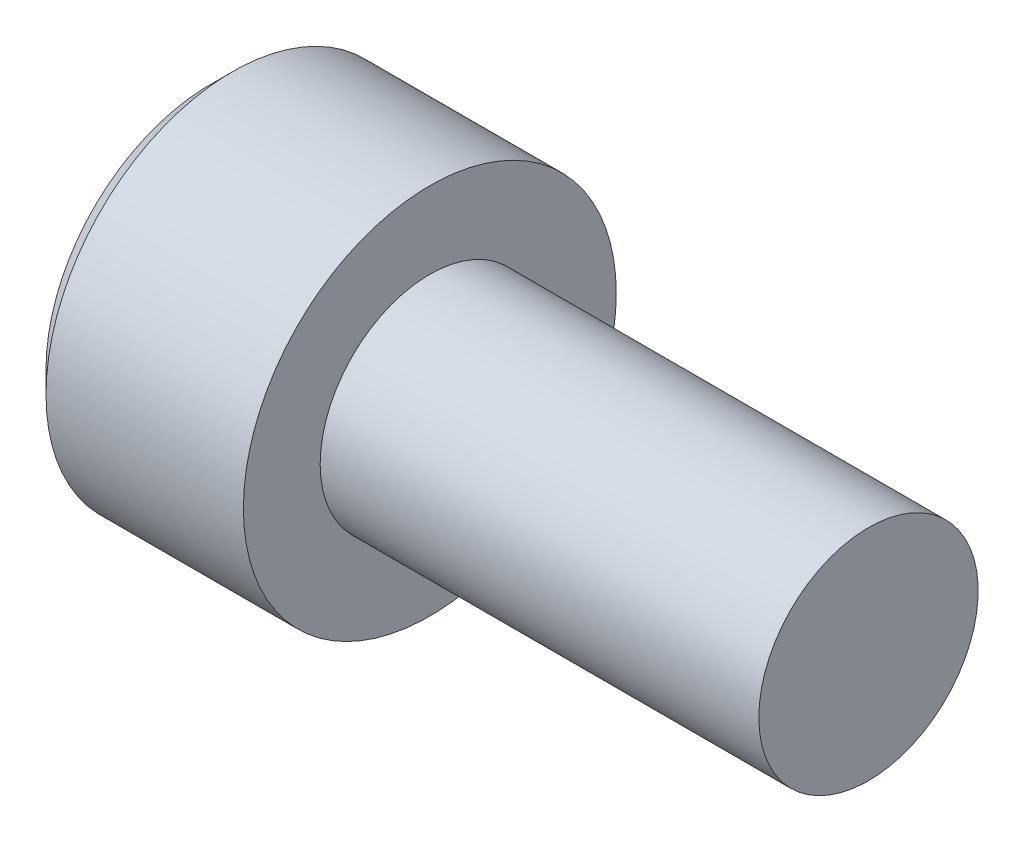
ISO-10303-21;
HEADER;
FILE_DESCRIPTION(('STEP AP214'),'2;1');
FILE_NAME('part.step','',(''),(''),'','','');
FILE_SCHEMA(('AUTOMOTIVE_DESIGN { 1 0 10303 214 1 1 1 1 }'));
ENDSEC;
DATA;
#1=APPLICATION_CONTEXT('core data for automotive mechanical design processes');
#2=APPLICATION_PROTOCOL_DEFINITION('international standard','automotive_design',2000,#1);
#3=PRODUCT_CONTEXT('',#1,'mechanical');
#4=PRODUCT('Part','Part','',(#3));
#5=PRODUCT_RELATED_PRODUCT_CATEGORY('part','',(#4));
#6=PRODUCT_DEFINITION_FORMATION('','',#4);
#7=PRODUCT_DEFINITION_CONTEXT('part definition',#1,'design');
#8=PRODUCT_DEFINITION('design','',#6,#7);
#9=PRODUCT_DEFINITION_SHAPE('','',#8);
#10=(LENGTH_UNIT() NAMED_UNIT(*) SI_UNIT(.MILLI.,.METRE.));
#11=(NAMED_UNIT(*) PLANE_ANGLE_UNIT() SI_UNIT($,.RADIAN.));
#12=(NAMED_UNIT(*) SI_UNIT($,.STERADIAN.) SOLID_ANGLE_UNIT());
#13=UNCERTAINTY_MEASURE_WITH_UNIT(LENGTH_MEASURE(1.E-05),#10,'distance_accuracy_value','');
#14=(GEOMETRIC_REPRESENTATION_CONTEXT(3) GLOBAL_UNCERTAINTY_ASSIGNED_CONTEXT((#13)) GLOBAL_UNIT_ASSIGNED_CONTEXT((#10,
#11,#12)) REPRESENTATION_CONTEXT('',''));
#15=CARTESIAN_POINT('',(0.,0.,0.));
#16=DIRECTION('',(0.,0.,1.));
#17=DIRECTION('',(1.,0.,0.));
#18=AXIS2_PLACEMENT_3D('',#15,#16,#17);
#19=CARTESIAN_POINT('',(0.,2.5,0.));
#20=DIRECTION('',(-1.,0.,0.));
#21=DIRECTION('',(0.,0.,1.));
#22=AXIS2_PLACEMENT_3D('',#19,#20,#21);
#23=PLANE('',#22);
#24=CARTESIAN_POINT('',(0.,0.,0.));
#25=DIRECTION('',(-1.,0.,0.));
#26=DIRECTION('',(0.,0.,1.));
#27=AXIS2_PLACEMENT_3D('',#24,#25,#26);
#28=CIRCLE('',#27,4.25);
#29=CARTESIAN_POINT('',(0.,0.,4.25));
#30=VERTEX_POINT('',#29);
#31=EDGE_CURVE('E147',#30,#30,#28,.T.);
#32=ORIENTED_EDGE('',*,*,#31,.F.);
#33=EDGE_LOOP('',(#32));
#34=FACE_BOUND('',#33,.T.);
#35=CARTESIAN_POINT('',(0.,0.,0.));
#36=DIRECTION('',(-1.,0.,0.));
#37=DIRECTION('',(0.,0.,1.));
#38=AXIS2_PLACEMENT_3D('',#35,#36,#37);
#39=CIRCLE('',#38,2.5);
#40=CARTESIAN_POINT('',(0.,0.,2.5));
#41=VERTEX_POINT('',#40);
#42=EDGE_CURVE('E136',#41,#41,#39,.T.);
#43=ORIENTED_EDGE('',*,*,#42,.T.);
#44=EDGE_LOOP('',(#43));
#45=FACE_BOUND('',#44,.T.);
#46=ADVANCED_FACE('F34',(#34,#45),#23,.F.);
#47=CARTESIAN_POINT('',(-5.,0.,0.));
#48=DIRECTION('',(-1.,0.,0.));
#49=DIRECTION('',(0.,0.,1.));
#50=AXIS2_PLACEMENT_3D('',#47,#48,#49);
#51=CYLINDRICAL_SURFACE('',#50,4.25);
#52=CARTESIAN_POINT('',(-4.5,0.,0.));
#53=DIRECTION('',(1.,0.,0.));
#54=DIRECTION('',(0.,0.,-1.));
#55=AXIS2_PLACEMENT_3D('',#52,#53,#54);
#56=CIRCLE('',#55,4.25);
#57=CARTESIAN_POINT('',(-4.5,0.,-4.25));
#58=VERTEX_POINT('',#57);
#59=EDGE_CURVE('E11',#58,#58,#56,.T.);
#60=ORIENTED_EDGE('',*,*,#59,.T.);
#61=EDGE_LOOP('',(#60));
#62=FACE_BOUND('',#61,.T.);
#63=ORIENTED_EDGE('',*,*,#31,.T.);
#64=EDGE_LOOP('',(#63));
#65=FACE_BOUND('',#64,.T.);
#66=ADVANCED_FACE('F164',(#62,#65),#51,.T.);
#67=CARTESIAN_POINT('',(-5.,0.,0.));
#68=DIRECTION('',(1.,0.,0.));
#69=DIRECTION('',(0.,0.,-1.));
#70=AXIS2_PLACEMENT_3D('',#67,#68,#69);
#71=PLANE('',#70);
#72=CARTESIAN_POINT('',(-5.,0.,0.));
#73=DIRECTION('',(1.,0.,0.));
#74=DIRECTION('',(0.,0.,-1.));
#75=AXIS2_PLACEMENT_3D('',#72,#73,#74);
#76=CIRCLE('',#75,3.75);
#77=CARTESIAN_POINT('',(-5.,0.,-3.75));
#78=VERTEX_POINT('',#77);
#79=EDGE_CURVE('E42',#78,#78,#76,.F.);
#80=ORIENTED_EDGE('',*,*,#79,.T.);
#81=EDGE_LOOP('',(#80));
#82=FACE_BOUND('',#81,.T.);
#83=DIRECTION('',(0.,0.5,-0.866025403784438));
#84=VECTOR('',#83,1.);
#85=CARTESIAN_POINT('',(-5.,1.15470053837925,2.));
#86=LINE('',#85,#84);
#87=CARTESIAN_POINT('',(-5.,1.15470053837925,2.));
#88=VERTEX_POINT('',#87);
#89=CARTESIAN_POINT('',(-5.,2.3094010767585,0.));
#90=VERTEX_POINT('',#89);
#91=EDGE_CURVE('E123',#88,#90,#86,.T.);
#92=ORIENTED_EDGE('',*,*,#91,.F.);
#93=DIRECTION('',(0.,1.,0.));
#94=VECTOR('',#93,1.);
#95=CARTESIAN_POINT('',(-5.,-1.15470053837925,2.));
#96=LINE('',#95,#94);
#97=CARTESIAN_POINT('',(-5.,-1.15470053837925,2.));
#98=VERTEX_POINT('',#97);
#99=EDGE_CURVE('E49',#98,#88,#96,.T.);
#100=ORIENTED_EDGE('',*,*,#99,.F.);
#101=DIRECTION('',(0.,0.5,0.866025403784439));
#102=VECTOR('',#101,1.);
#103=CARTESIAN_POINT('',(-5.,-2.3094010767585,0.));
#104=LINE('',#103,#102);
#105=CARTESIAN_POINT('',(-5.,-2.3094010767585,0.));
#106=VERTEX_POINT('',#105);
#107=EDGE_CURVE('E132',#106,#98,#104,.T.);
#108=ORIENTED_EDGE('',*,*,#107,.F.);
#109=DIRECTION('',(0.,-0.5,0.866025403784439));
#110=VECTOR('',#109,1.);
#111=CARTESIAN_POINT('',(-5.,-1.15470053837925,-2.));
#112=LINE('',#111,#110);
#113=CARTESIAN_POINT('',(-5.,-1.15470053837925,-2.));
#114=VERTEX_POINT('',#113);
#115=EDGE_CURVE('E130',#114,#106,#112,.T.);
#116=ORIENTED_EDGE('',*,*,#115,.F.);
#117=DIRECTION('',(0.,-1.,0.));
#118=VECTOR('',#117,1.);
#119=CARTESIAN_POINT('',(-5.,1.15470053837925,-2.));
#120=LINE('',#119,#118);
#121=CARTESIAN_POINT('',(-5.,1.15470053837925,-2.));
#122=VERTEX_POINT('',#121);
#123=EDGE_CURVE('E97',#122,#114,#120,.T.);
#124=ORIENTED_EDGE('',*,*,#123,.F.);
#125=DIRECTION('',(0.,-0.5,-0.866025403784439));
#126=VECTOR('',#125,1.);
#127=CARTESIAN_POINT('',(-5.,2.3094010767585,0.));
#128=LINE('',#127,#126);
#129=EDGE_CURVE('E126',#90,#122,#128,.T.);
#130=ORIENTED_EDGE('',*,*,#129,.F.);
#131=EDGE_LOOP('',(#92,#100,#108,#116,#124,#130));
#132=FACE_BOUND('',#131,.T.);
#133=ADVANCED_FACE('F152',(#82,#132),#71,.F.);
#134=CARTESIAN_POINT('',(10.,2.5,0.));
#135=DIRECTION('',(-1.,0.,0.));
#136=DIRECTION('',(0.,0.,1.));
#137=AXIS2_PLACEMENT_3D('',#134,#135,#136);
#138=PLANE('',#137);
#139=CARTESIAN_POINT('',(10.,0.,0.));
#140=DIRECTION('',(-1.,0.,0.));
#141=DIRECTION('',(0.,0.,1.));
#142=AXIS2_PLACEMENT_3D('',#139,#140,#141);
#143=CIRCLE('',#142,2.5);
#144=CARTESIAN_POINT('',(10.,0.,2.5));
#145=VERTEX_POINT('',#144);
#146=EDGE_CURVE('E144',#145,#145,#143,.T.);
#147=ORIENTED_EDGE('',*,*,#146,.F.);
#148=EDGE_LOOP('',(#147));
#149=FACE_BOUND('',#148,.T.);
#150=ADVANCED_FACE('F176',(#149),#138,.F.);
#151=CARTESIAN_POINT('',(-5.,0.,0.));
#152=DIRECTION('',(-1.,0.,0.));
#153=DIRECTION('',(0.,0.,1.));
#154=AXIS2_PLACEMENT_3D('',#151,#152,#153);
#155=CYLINDRICAL_SURFACE('',#154,2.5);
#156=ORIENTED_EDGE('',*,*,#42,.F.);
#157=EDGE_LOOP('',(#156));
#158=FACE_BOUND('',#157,.T.);
#159=ORIENTED_EDGE('',*,*,#146,.T.);
#160=EDGE_LOOP('',(#159));
#161=FACE_BOUND('',#160,.T.);
#162=ADVANCED_FACE('F179',(#158,#161),#155,.T.);
#163=CARTESIAN_POINT('',(-2.5,-1.15470053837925,2.));
#164=DIRECTION('',(0.,0.,1.));
#165=DIRECTION('',(0.,-1.,0.));
#166=AXIS2_PLACEMENT_3D('',#163,#164,#165);
#167=PLANE('',#166);
#168=ORIENTED_EDGE('',*,*,#99,.T.);
#169=DIRECTION('',(-1.,0.,0.));
#170=VECTOR('',#169,1.);
#171=CARTESIAN_POINT('',(-2.5,1.15470053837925,2.));
#172=LINE('',#171,#170);
#173=CARTESIAN_POINT('',(-2.5,1.15470053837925,2.));
#174=VERTEX_POINT('',#173);
#175=EDGE_CURVE('E79',#174,#88,#172,.T.);
#176=ORIENTED_EDGE('',*,*,#175,.F.);
#177=DIRECTION('',(0.,1.,0.));
#178=VECTOR('',#177,1.);
#179=CARTESIAN_POINT('',(-2.5,-1.15470053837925,2.));
#180=LINE('',#179,#178);
#181=CARTESIAN_POINT('',(-2.5,-1.15470053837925,2.));
#182=VERTEX_POINT('',#181);
#183=EDGE_CURVE('E134',#182,#174,#180,.T.);
#184=ORIENTED_EDGE('',*,*,#183,.F.);
#185=DIRECTION('',(-1.,0.,0.));
#186=VECTOR('',#185,1.);
#187=CARTESIAN_POINT('',(-2.5,-1.15470053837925,2.));
#188=LINE('',#187,#186);
#189=EDGE_CURVE('E57',#182,#98,#188,.T.);
#190=ORIENTED_EDGE('',*,*,#189,.T.);
#191=EDGE_LOOP('',(#168,#176,#184,#190));
#192=FACE_BOUND('',#191,.T.);
#193=ADVANCED_FACE('F183',(#192),#167,.F.);
#194=CARTESIAN_POINT('',(-2.5,-2.3094010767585,0.));
#195=DIRECTION('',(0.,-0.866025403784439,0.5));
#196=DIRECTION('',(0.,-0.5,-0.866025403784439));
#197=AXIS2_PLACEMENT_3D('',#194,#195,#196);
#198=PLANE('',#197);
#199=ORIENTED_EDGE('',*,*,#107,.T.);
#200=ORIENTED_EDGE('',*,*,#189,.F.);
#201=DIRECTION('',(0.,0.5,0.866025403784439));
#202=VECTOR('',#201,1.);
#203=CARTESIAN_POINT('',(-2.5,-2.3094010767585,0.));
#204=LINE('',#203,#202);
#205=CARTESIAN_POINT('',(-2.5,-2.3094010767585,0.));
#206=VERTEX_POINT('',#205);
#207=EDGE_CURVE('E109',#206,#182,#204,.T.);
#208=ORIENTED_EDGE('',*,*,#207,.F.);
#209=DIRECTION('',(-1.,0.,0.));
#210=VECTOR('',#209,1.);
#211=CARTESIAN_POINT('',(-2.5,-2.3094010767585,0.));
#212=LINE('',#211,#210);
#213=EDGE_CURVE('E101',#206,#106,#212,.T.);
#214=ORIENTED_EDGE('',*,*,#213,.T.);
#215=EDGE_LOOP('',(#199,#200,#208,#214));
#216=FACE_BOUND('',#215,.T.);
#217=ADVANCED_FACE('F187',(#216),#198,.F.);
#218=CARTESIAN_POINT('',(-2.5,-1.15470053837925,-2.));
#219=DIRECTION('',(0.,-0.866025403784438,-0.5));
#220=DIRECTION('',(0.,0.5,-0.866025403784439));
#221=AXIS2_PLACEMENT_3D('',#218,#219,#220);
#222=PLANE('',#221);
#223=ORIENTED_EDGE('',*,*,#115,.T.);
#224=ORIENTED_EDGE('',*,*,#213,.F.);
#225=DIRECTION('',(0.,-0.5,0.866025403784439));
#226=VECTOR('',#225,1.);
#227=CARTESIAN_POINT('',(-2.5,-1.15470053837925,-2.));
#228=LINE('',#227,#226);
#229=CARTESIAN_POINT('',(-2.5,-1.15470053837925,-2.));
#230=VERTEX_POINT('',#229);
#231=EDGE_CURVE('E105',#230,#206,#228,.T.);
#232=ORIENTED_EDGE('',*,*,#231,.F.);
#233=DIRECTION('',(-1.,0.,0.));
#234=VECTOR('',#233,1.);
#235=CARTESIAN_POINT('',(-2.5,-1.15470053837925,-2.));
#236=LINE('',#235,#234);
#237=EDGE_CURVE('E90',#230,#114,#236,.T.);
#238=ORIENTED_EDGE('',*,*,#237,.T.);
#239=EDGE_LOOP('',(#223,#224,#232,#238));
#240=FACE_BOUND('',#239,.T.);
#241=ADVANCED_FACE('F106',(#240),#222,.F.);
#242=CARTESIAN_POINT('',(-2.5,1.15470053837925,-2.));
#243=DIRECTION('',(0.,0.,-1.));
#244=DIRECTION('',(-1.,0.,0.));
#245=AXIS2_PLACEMENT_3D('',#242,#243,#244);
#246=PLANE('',#245);
#247=ORIENTED_EDGE('',*,*,#123,.T.);
#248=ORIENTED_EDGE('',*,*,#237,.F.);
#249=DIRECTION('',(0.,-1.,0.));
#250=VECTOR('',#249,1.);
#251=CARTESIAN_POINT('',(-2.5,1.15470053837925,-2.));
#252=LINE('',#251,#250);
#253=CARTESIAN_POINT('',(-2.5,1.15470053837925,-2.));
#254=VERTEX_POINT('',#253);
#255=EDGE_CURVE('E94',#254,#230,#252,.T.);
#256=ORIENTED_EDGE('',*,*,#255,.F.);
#257=DIRECTION('',(-1.,0.,0.));
#258=VECTOR('',#257,1.);
#259=CARTESIAN_POINT('',(-2.5,1.15470053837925,-2.));
#260=LINE('',#259,#258);
#261=EDGE_CURVE('E102',#254,#122,#260,.T.);
#262=ORIENTED_EDGE('',*,*,#261,.T.);
#263=EDGE_LOOP('',(#247,#248,#256,#262));
#264=FACE_BOUND('',#263,.T.);
#265=ADVANCED_FACE('F92',(#264),#246,.F.);
#266=CARTESIAN_POINT('',(-2.5,2.3094010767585,0.));
#267=DIRECTION('',(0.,0.866025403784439,-0.5));
#268=DIRECTION('',(0.,0.5,0.866025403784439));
#269=AXIS2_PLACEMENT_3D('',#266,#267,#268);
#270=PLANE('',#269);
#271=ORIENTED_EDGE('',*,*,#129,.T.);
#272=ORIENTED_EDGE('',*,*,#261,.F.);
#273=DIRECTION('',(0.,-0.5,-0.866025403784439));
#274=VECTOR('',#273,1.);
#275=CARTESIAN_POINT('',(-2.5,2.3094010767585,0.));
#276=LINE('',#275,#274);
#277=CARTESIAN_POINT('',(-2.5,2.3094010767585,0.));
#278=VERTEX_POINT('',#277);
#279=EDGE_CURVE('E115',#278,#254,#276,.T.);
#280=ORIENTED_EDGE('',*,*,#279,.F.);
#281=DIRECTION('',(-1.,0.,0.));
#282=VECTOR('',#281,1.);
#283=CARTESIAN_POINT('',(-2.5,2.3094010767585,0.));
#284=LINE('',#283,#282);
#285=EDGE_CURVE('E139',#278,#90,#284,.T.);
#286=ORIENTED_EDGE('',*,*,#285,.T.);
#287=EDGE_LOOP('',(#271,#272,#280,#286));
#288=FACE_BOUND('',#287,.T.);
#289=ADVANCED_FACE('F190',(#288),#270,.F.);
#290=CARTESIAN_POINT('',(-2.5,1.15470053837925,2.));
#291=DIRECTION('',(0.,0.866025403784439,0.5));
#292=DIRECTION('',(0.,-0.5,0.866025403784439));
#293=AXIS2_PLACEMENT_3D('',#290,#291,#292);
#294=PLANE('',#293);
#295=ORIENTED_EDGE('',*,*,#91,.T.);
#296=ORIENTED_EDGE('',*,*,#285,.F.);
#297=DIRECTION('',(0.,0.5,-0.866025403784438));
#298=VECTOR('',#297,1.);
#299=CARTESIAN_POINT('',(-2.5,1.15470053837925,2.));
#300=LINE('',#299,#298);
#301=EDGE_CURVE('E117',#174,#278,#300,.T.);
#302=ORIENTED_EDGE('',*,*,#301,.F.);
#303=ORIENTED_EDGE('',*,*,#175,.T.);
#304=EDGE_LOOP('',(#295,#296,#302,#303));
#305=FACE_BOUND('',#304,.T.);
#306=ADVANCED_FACE('F160',(#305),#294,.F.);
#307=CARTESIAN_POINT('',(-2.5,0.,0.));
#308=DIRECTION('',(-1.,0.,0.));
#309=DIRECTION('',(0.,0.,1.));
#310=AXIS2_PLACEMENT_3D('',#307,#308,#309);
#311=PLANE('',#310);
#312=ORIENTED_EDGE('',*,*,#183,.T.);
#313=ORIENTED_EDGE('',*,*,#301,.T.);
#314=ORIENTED_EDGE('',*,*,#279,.T.);
#315=ORIENTED_EDGE('',*,*,#255,.T.);
#316=ORIENTED_EDGE('',*,*,#231,.T.);
#317=ORIENTED_EDGE('',*,*,#207,.T.);
#318=EDGE_LOOP('',(#312,#313,#314,#315,#316,#317));
#319=FACE_BOUND('',#318,.T.);
#320=ADVANCED_FACE('F112',(#319),#311,.T.);
#321=CARTESIAN_POINT('',(-5.,0.,0.));
#322=DIRECTION('',(1.,0.,0.));
#323=DIRECTION('',(0.,0.,-1.));
#324=AXIS2_PLACEMENT_3D('',#321,#322,#323);
#325=CONICAL_SURFACE('',#324,3.75,0.785398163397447);
#326=ORIENTED_EDGE('',*,*,#59,.F.);
#327=EDGE_LOOP('',(#326));
#328=FACE_BOUND('',#327,.T.);
#329=ORIENTED_EDGE('',*,*,#79,.F.);
#330=EDGE_LOOP('',(#329));
#331=FACE_BOUND('',#330,.T.);
#332=ADVANCED_FACE('F36',(#328,#331),#325,.T.);
#333=CLOSED_SHELL('',(#46,#66,#133,#150,#162,#193,#217,#241,#265,#289,#306,#320,#332));
#334=MANIFOLD_SOLID_BREP('B2',#333);
#335=ADVANCED_BREP_SHAPE_REPRESENTATION('',(#18,#334),#14);
#336=SHAPE_DEFINITION_REPRESENTATION(#9,#335);
ENDSEC;
END-ISO-10303-21;
